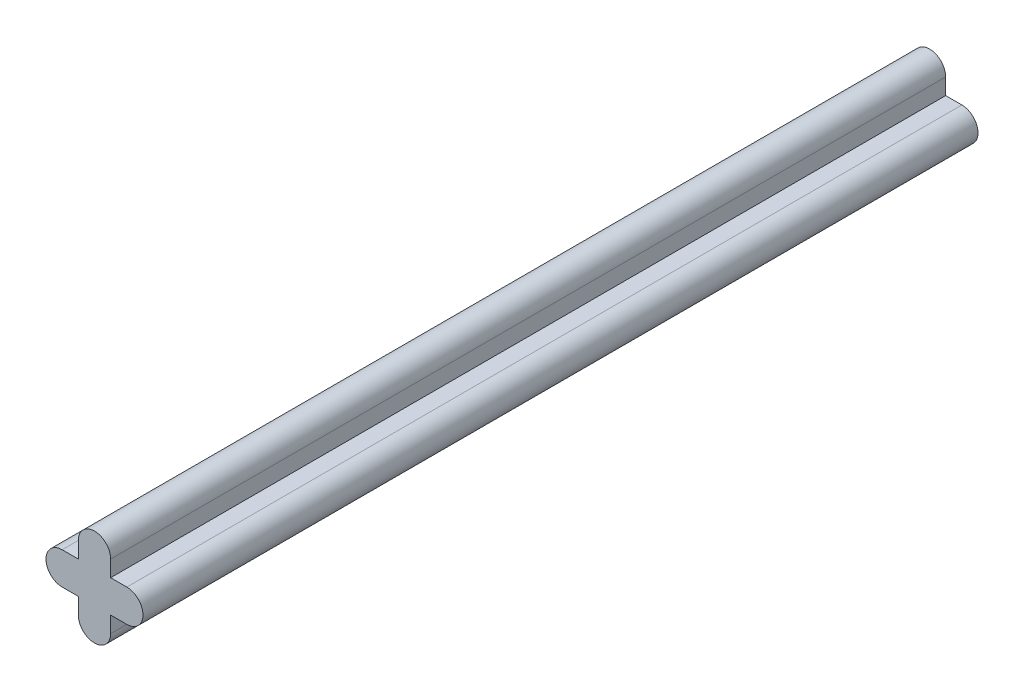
from build123d import *

# Parameters (mm, degrees)
BOSS_EXTRUDE1_DEPTH = 39.37


with BuildPart() as part:
    # Sketch1 → Boss-Extrude1 (new body)
    with BuildSketch(Plane.XY):
        with BuildLine():
            Line((0, 0.762), (3.048, 0.762))
            ThreePointArc((3.048, 0.762), (3.81, 0), (3.048, -0.762))
            Line((3.048, -0.762), (0, -0.762))
            ThreePointArc((0, -0.762), (-0.762, 0), (0, 0.762))
        make_face()
        with BuildLine():
            Line((2.286, 1.524), (2.286, -1.524))
            ThreePointArc((2.286, -1.524), (1.524, -2.286), (0.762, -1.524))
            Line((0.762, -1.524), (0.762, 1.524))
            ThreePointArc((0.762, 1.524), (1.524, 2.286), (2.286, 1.524))
        make_face()
    extrude(amount=BOSS_EXTRUDE1_DEPTH)


solid = part.part
